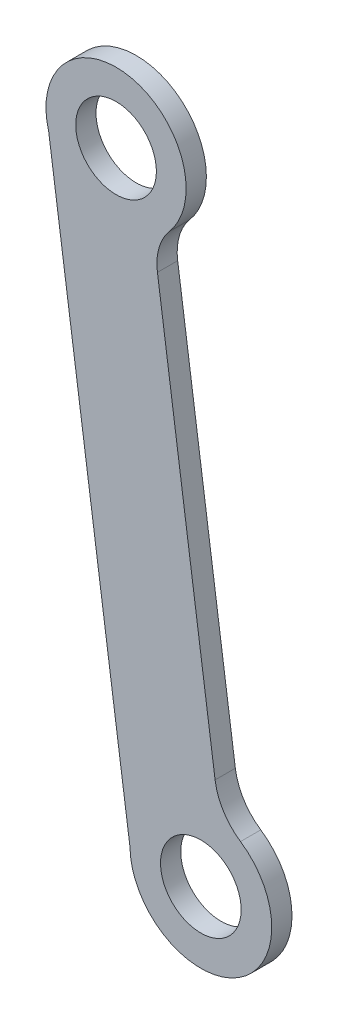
ISO-10303-21;
HEADER;
FILE_DESCRIPTION(('STEP AP214'),'2;1');
FILE_NAME('part.step','',(''),(''),'','','');
FILE_SCHEMA(('AUTOMOTIVE_DESIGN { 1 0 10303 214 1 1 1 1 }'));
ENDSEC;
DATA;
#1=APPLICATION_CONTEXT('core data for automotive mechanical design processes');
#2=APPLICATION_PROTOCOL_DEFINITION('international standard','automotive_design',2000,#1);
#3=PRODUCT_CONTEXT('',#1,'mechanical');
#4=PRODUCT('Part','Part','',(#3));
#5=PRODUCT_RELATED_PRODUCT_CATEGORY('part','',(#4));
#6=PRODUCT_DEFINITION_FORMATION('','',#4);
#7=PRODUCT_DEFINITION_CONTEXT('part definition',#1,'design');
#8=PRODUCT_DEFINITION('design','',#6,#7);
#9=PRODUCT_DEFINITION_SHAPE('','',#8);
#10=(LENGTH_UNIT() NAMED_UNIT(*) SI_UNIT(.MILLI.,.METRE.));
#11=(NAMED_UNIT(*) PLANE_ANGLE_UNIT() SI_UNIT($,.RADIAN.));
#12=(NAMED_UNIT(*) SI_UNIT($,.STERADIAN.) SOLID_ANGLE_UNIT());
#13=UNCERTAINTY_MEASURE_WITH_UNIT(LENGTH_MEASURE(1.E-05),#10,'distance_accuracy_value','');
#14=(GEOMETRIC_REPRESENTATION_CONTEXT(3) GLOBAL_UNCERTAINTY_ASSIGNED_CONTEXT((#13)) GLOBAL_UNIT_ASSIGNED_CONTEXT((#10,
#11,#12)) REPRESENTATION_CONTEXT('',''));
#15=CARTESIAN_POINT('',(0.,0.,0.));
#16=DIRECTION('',(0.,0.,1.));
#17=DIRECTION('',(1.,0.,0.));
#18=AXIS2_PLACEMENT_3D('',#15,#16,#17);
#19=CARTESIAN_POINT('',(355.121430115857,236.791402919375,-2.));
#20=DIRECTION('',(0.,0.,1.));
#21=DIRECTION('',(-0.961342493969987,-0.275355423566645,0.));
#22=AXIS2_PLACEMENT_3D('',#19,#20,#21);
#23=CYLINDRICAL_SURFACE('',#22,5.81601703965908);
#24=CARTESIAN_POINT('',(355.121430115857,236.791402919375,0.));
#25=DIRECTION('',(0.,0.,1.));
#26=DIRECTION('',(0.961342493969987,0.275355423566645,0.));
#27=AXIS2_PLACEMENT_3D('',#24,#25,#26);
#28=CIRCLE('',#27,5.81601703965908);
#29=CARTESIAN_POINT('',(349.361895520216,235.982814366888,0.));
#30=VERTEX_POINT('',#29);
#31=CARTESIAN_POINT('',(351.872505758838,231.967447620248,0.));
#32=VERTEX_POINT('',#31);
#33=EDGE_CURVE('E91',#30,#32,#28,.T.);
#34=ORIENTED_EDGE('',*,*,#33,.T.);
#35=DIRECTION('',(0.,0.,1.));
#36=VECTOR('',#35,1.);
#37=CARTESIAN_POINT('',(351.872505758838,231.967447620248,-2.));
#38=LINE('',#37,#36);
#39=CARTESIAN_POINT('',(351.872505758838,231.967447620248,-2.));
#40=VERTEX_POINT('',#39);
#41=EDGE_CURVE('E35',#40,#32,#38,.T.);
#42=ORIENTED_EDGE('',*,*,#41,.F.);
#43=CARTESIAN_POINT('',(355.121430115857,236.791402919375,-2.));
#44=DIRECTION('',(0.,0.,1.));
#45=DIRECTION('',(0.961342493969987,0.275355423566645,0.));
#46=AXIS2_PLACEMENT_3D('',#43,#44,#45);
#47=CIRCLE('',#46,5.81601703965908);
#48=CARTESIAN_POINT('',(349.361895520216,235.982814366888,-2.));
#49=VERTEX_POINT('',#48);
#50=EDGE_CURVE('E118',#49,#40,#47,.T.);
#51=ORIENTED_EDGE('',*,*,#50,.F.);
#52=DIRECTION('',(0.,0.,1.));
#53=VECTOR('',#52,1.);
#54=CARTESIAN_POINT('',(349.361895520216,235.982814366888,-2.));
#55=LINE('',#54,#53);
#56=EDGE_CURVE('E11',#49,#30,#55,.T.);
#57=ORIENTED_EDGE('',*,*,#56,.T.);
#58=EDGE_LOOP('',(#34,#42,#51,#57));
#59=FACE_BOUND('',#58,.T.);
#60=ADVANCED_FACE('F32',(#59),#23,.F.);
#61=CARTESIAN_POINT('',(349.361895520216,235.982814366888,-2.));
#62=DIRECTION('',(0.990288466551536,0.139027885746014,0.));
#63=DIRECTION('',(0.139027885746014,-0.990288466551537,0.));
#64=AXIS2_PLACEMENT_3D('',#61,#62,#63);
#65=PLANE('',#64);
#66=DIRECTION('',(0.139027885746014,-0.990288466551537,0.));
#67=VECTOR('',#66,1.);
#68=CARTESIAN_POINT('',(349.361895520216,235.982814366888,0.));
#69=LINE('',#68,#67);
#70=CARTESIAN_POINT('',(343.668341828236,276.53770394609,0.));
#71=VERTEX_POINT('',#70);
#72=EDGE_CURVE('E116',#71,#30,#69,.T.);
#73=ORIENTED_EDGE('',*,*,#72,.T.);
#74=ORIENTED_EDGE('',*,*,#56,.F.);
#75=DIRECTION('',(0.139027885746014,-0.990288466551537,0.));
#76=VECTOR('',#75,1.);
#77=CARTESIAN_POINT('',(349.361895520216,235.982814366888,-2.));
#78=LINE('',#77,#76);
#79=CARTESIAN_POINT('',(343.668341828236,276.53770394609,-2.));
#80=VERTEX_POINT('',#79);
#81=EDGE_CURVE('E48',#80,#49,#78,.T.);
#82=ORIENTED_EDGE('',*,*,#81,.F.);
#83=DIRECTION('',(0.,0.,1.));
#84=VECTOR('',#83,1.);
#85=CARTESIAN_POINT('',(343.668341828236,276.53770394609,-2.));
#86=LINE('',#85,#84);
#87=EDGE_CURVE('E40',#80,#71,#86,.T.);
#88=ORIENTED_EDGE('',*,*,#87,.T.);
#89=EDGE_LOOP('',(#73,#74,#82,#88));
#90=FACE_BOUND('',#89,.T.);
#91=ADVANCED_FACE('F147',(#90),#65,.T.);
#92=CARTESIAN_POINT('',(348.856927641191,277.266136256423,-2.));
#93=DIRECTION('',(0.,0.,1.));
#94=DIRECTION('',(-0.961342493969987,-0.275355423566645,0.));
#95=AXIS2_PLACEMENT_3D('',#92,#93,#94);
#96=CYLINDRICAL_SURFACE('',#95,5.23946909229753);
#97=CARTESIAN_POINT('',(348.856927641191,277.266136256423,0.));
#98=DIRECTION('',(0.,0.,1.));
#99=DIRECTION('',(-0.961342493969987,-0.275355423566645,0.));
#100=AXIS2_PLACEMENT_3D('',#97,#98,#99);
#101=CIRCLE('',#100,5.23946909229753);
#102=CARTESIAN_POINT('',(344.756292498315,280.527551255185,0.));
#103=VERTEX_POINT('',#102);
#104=EDGE_CURVE('E114',#103,#71,#101,.T.);
#105=ORIENTED_EDGE('',*,*,#104,.T.);
#106=ORIENTED_EDGE('',*,*,#87,.F.);
#107=CARTESIAN_POINT('',(348.856927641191,277.266136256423,-2.));
#108=DIRECTION('',(0.,0.,1.));
#109=DIRECTION('',(-0.961342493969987,-0.275355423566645,0.));
#110=AXIS2_PLACEMENT_3D('',#107,#108,#109);
#111=CIRCLE('',#110,5.23946909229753);
#112=CARTESIAN_POINT('',(344.756292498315,280.527551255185,-2.));
#113=VERTEX_POINT('',#112);
#114=EDGE_CURVE('E53',#113,#80,#111,.T.);
#115=ORIENTED_EDGE('',*,*,#114,.F.);
#116=DIRECTION('',(0.,0.,1.));
#117=VECTOR('',#116,1.);
#118=CARTESIAN_POINT('',(344.756292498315,280.527551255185,-2.));
#119=LINE('',#118,#117);
#120=EDGE_CURVE('E129',#113,#103,#119,.T.);
#121=ORIENTED_EDGE('',*,*,#120,.T.);
#122=EDGE_LOOP('',(#105,#106,#115,#121));
#123=FACE_BOUND('',#122,.T.);
#124=ADVANCED_FACE('F145',(#123),#96,.F.);
#125=CARTESIAN_POINT('',(339.583114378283,285.123562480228,-2.));
#126=DIRECTION('',(0.,0.,1.));
#127=DIRECTION('',(-0.961342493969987,-0.275355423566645,0.));
#128=AXIS2_PLACEMENT_3D('',#125,#126,#127);
#129=CYLINDRICAL_SURFACE('',#128,6.91990542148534);
#130=CARTESIAN_POINT('',(339.583114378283,285.123562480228,0.));
#131=DIRECTION('',(0.,0.,-1.));
#132=DIRECTION('',(-0.961342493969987,-0.275355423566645,0.));
#133=AXIS2_PLACEMENT_3D('',#130,#131,#132);
#134=CIRCLE('',#133,6.91990542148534);
#135=CARTESIAN_POINT('',(332.930715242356,283.218128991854,0.));
#136=VERTEX_POINT('',#135);
#137=EDGE_CURVE('E112',#136,#103,#134,.T.);
#138=ORIENTED_EDGE('',*,*,#137,.T.);
#139=ORIENTED_EDGE('',*,*,#120,.F.);
#140=CARTESIAN_POINT('',(339.583114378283,285.123562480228,-2.));
#141=DIRECTION('',(0.,0.,-1.));
#142=DIRECTION('',(-0.961342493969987,-0.275355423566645,0.));
#143=AXIS2_PLACEMENT_3D('',#140,#141,#142);
#144=CIRCLE('',#143,6.91990542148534);
#145=CARTESIAN_POINT('',(332.930715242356,283.218128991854,-2.));
#146=VERTEX_POINT('',#145);
#147=EDGE_CURVE('E123',#146,#113,#144,.T.);
#148=ORIENTED_EDGE('',*,*,#147,.F.);
#149=DIRECTION('',(0.,0.,1.));
#150=VECTOR('',#149,1.);
#151=CARTESIAN_POINT('',(332.930715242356,283.218128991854,-2.));
#152=LINE('',#151,#150);
#153=EDGE_CURVE('E132',#146,#136,#152,.T.);
#154=ORIENTED_EDGE('',*,*,#153,.T.);
#155=EDGE_LOOP('',(#138,#139,#148,#154));
#156=FACE_BOUND('',#155,.T.);
#157=ADVANCED_FACE('F142',(#156),#129,.T.);
#158=CARTESIAN_POINT('',(332.930715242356,283.218128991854,-2.));
#159=DIRECTION('',(-0.990288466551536,-0.139027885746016,0.));
#160=DIRECTION('',(-0.139027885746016,0.990288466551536,0.));
#161=AXIS2_PLACEMENT_3D('',#158,#159,#160);
#162=PLANE('',#161);
#163=DIRECTION('',(-0.139027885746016,0.990288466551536,0.));
#164=VECTOR('',#163,1.);
#165=CARTESIAN_POINT('',(332.930715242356,283.218128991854,0.));
#166=LINE('',#165,#164);
#167=CARTESIAN_POINT('',(340.954066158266,226.068213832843,0.));
#168=VERTEX_POINT('',#167);
#169=EDGE_CURVE('E93',#168,#136,#166,.T.);
#170=ORIENTED_EDGE('',*,*,#169,.T.);
#171=ORIENTED_EDGE('',*,*,#153,.F.);
#172=DIRECTION('',(-0.139027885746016,0.990288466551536,0.));
#173=VECTOR('',#172,1.);
#174=CARTESIAN_POINT('',(332.930715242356,283.218128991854,-2.));
#175=LINE('',#174,#173);
#176=CARTESIAN_POINT('',(340.954066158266,226.068213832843,-2.));
#177=VERTEX_POINT('',#176);
#178=EDGE_CURVE('E121',#177,#146,#175,.T.);
#179=ORIENTED_EDGE('',*,*,#178,.F.);
#180=DIRECTION('',(0.,0.,1.));
#181=VECTOR('',#180,1.);
#182=CARTESIAN_POINT('',(340.954066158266,226.068213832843,-2.));
#183=LINE('',#182,#181);
#184=EDGE_CURVE('E103',#177,#168,#183,.T.);
#185=ORIENTED_EDGE('',*,*,#184,.T.);
#186=EDGE_LOOP('',(#170,#171,#179,#185));
#187=FACE_BOUND('',#186,.T.);
#188=ADVANCED_FACE('F136',(#187),#162,.T.);
#189=CARTESIAN_POINT('',(347.95470235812,226.164941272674,-2.));
#190=DIRECTION('',(0.,0.,1.));
#191=DIRECTION('',(-0.961342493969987,-0.275355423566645,0.));
#192=AXIS2_PLACEMENT_3D('',#189,#190,#191);
#193=CYLINDRICAL_SURFACE('',#192,7.00130440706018);
#194=CARTESIAN_POINT('',(347.95470235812,226.164941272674,0.));
#195=DIRECTION('',(0.,0.,-1.));
#196=DIRECTION('',(-0.961342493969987,-0.275355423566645,0.));
#197=AXIS2_PLACEMENT_3D('',#194,#195,#196);
#198=CIRCLE('',#197,7.00130440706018);
#199=EDGE_CURVE('E86',#32,#168,#198,.T.);
#200=ORIENTED_EDGE('',*,*,#199,.T.);
#201=ORIENTED_EDGE('',*,*,#184,.F.);
#202=CARTESIAN_POINT('',(347.95470235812,226.164941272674,-2.));
#203=DIRECTION('',(0.,0.,-1.));
#204=DIRECTION('',(-0.961342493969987,-0.275355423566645,0.));
#205=AXIS2_PLACEMENT_3D('',#202,#203,#204);
#206=CIRCLE('',#205,7.00130440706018);
#207=EDGE_CURVE('E100',#40,#177,#206,.T.);
#208=ORIENTED_EDGE('',*,*,#207,.F.);
#209=ORIENTED_EDGE('',*,*,#41,.T.);
#210=EDGE_LOOP('',(#200,#201,#208,#209));
#211=FACE_BOUND('',#210,.T.);
#212=ADVANCED_FACE('F99',(#211),#193,.T.);
#213=CARTESIAN_POINT('',(355.121430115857,236.791402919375,-2.));
#214=DIRECTION('',(0.,0.,-1.));
#215=DIRECTION('',(0.961342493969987,0.275355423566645,0.));
#216=AXIS2_PLACEMENT_3D('',#213,#214,#215);
#217=PLANE('',#216);
#218=CARTESIAN_POINT('',(339.583114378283,285.123562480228,-2.));
#219=DIRECTION('',(0.,0.,-1.));
#220=DIRECTION('',(-0.961342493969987,-0.275355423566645,0.));
#221=AXIS2_PLACEMENT_3D('',#218,#219,#220);
#222=CIRCLE('',#221,3.98165201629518);
#223=CARTESIAN_POINT('',(335.755383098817,284.027193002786,-2.));
#224=VERTEX_POINT('',#223);
#225=EDGE_CURVE('E174',#224,#224,#222,.T.);
#226=ORIENTED_EDGE('',*,*,#225,.F.);
#227=EDGE_LOOP('',(#226));
#228=FACE_BOUND('',#227,.T.);
#229=CARTESIAN_POINT('',(347.95470235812,226.164941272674,-2.));
#230=DIRECTION('',(0.,0.,-1.));
#231=DIRECTION('',(-0.961342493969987,-0.275355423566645,0.));
#232=AXIS2_PLACEMENT_3D('',#229,#230,#231);
#233=CIRCLE('',#232,3.98165201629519);
#234=CARTESIAN_POINT('',(344.126971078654,225.068571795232,-2.));
#235=VERTEX_POINT('',#234);
#236=EDGE_CURVE('E104',#235,#235,#233,.T.);
#237=ORIENTED_EDGE('',*,*,#236,.F.);
#238=EDGE_LOOP('',(#237));
#239=FACE_BOUND('',#238,.T.);
#240=ORIENTED_EDGE('',*,*,#50,.T.);
#241=ORIENTED_EDGE('',*,*,#207,.T.);
#242=ORIENTED_EDGE('',*,*,#178,.T.);
#243=ORIENTED_EDGE('',*,*,#147,.T.);
#244=ORIENTED_EDGE('',*,*,#114,.T.);
#245=ORIENTED_EDGE('',*,*,#81,.T.);
#246=EDGE_LOOP('',(#240,#241,#242,#243,#244,#245));
#247=FACE_BOUND('',#246,.T.);
#248=ADVANCED_FACE('F139',(#228,#239,#247),#217,.T.);
#249=CARTESIAN_POINT('',(355.121430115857,236.791402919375,0.));
#250=DIRECTION('',(0.,0.,-1.));
#251=DIRECTION('',(0.961342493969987,0.275355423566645,0.));
#252=AXIS2_PLACEMENT_3D('',#249,#250,#251);
#253=PLANE('',#252);
#254=CARTESIAN_POINT('',(339.583114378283,285.123562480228,0.));
#255=DIRECTION('',(0.,0.,-1.));
#256=DIRECTION('',(-0.961342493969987,-0.275355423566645,0.));
#257=AXIS2_PLACEMENT_3D('',#254,#255,#256);
#258=CIRCLE('',#257,3.98165201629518);
#259=CARTESIAN_POINT('',(335.755383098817,284.027193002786,0.));
#260=VERTEX_POINT('',#259);
#261=EDGE_CURVE('E184',#260,#260,#258,.T.);
#262=ORIENTED_EDGE('',*,*,#261,.T.);
#263=EDGE_LOOP('',(#262));
#264=FACE_BOUND('',#263,.T.);
#265=CARTESIAN_POINT('',(347.95470235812,226.164941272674,0.));
#266=DIRECTION('',(0.,0.,-1.));
#267=DIRECTION('',(-0.961342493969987,-0.275355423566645,0.));
#268=AXIS2_PLACEMENT_3D('',#265,#266,#267);
#269=CIRCLE('',#268,3.98165201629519);
#270=CARTESIAN_POINT('',(344.126971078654,225.068571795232,0.));
#271=VERTEX_POINT('',#270);
#272=EDGE_CURVE('E107',#271,#271,#269,.T.);
#273=ORIENTED_EDGE('',*,*,#272,.T.);
#274=EDGE_LOOP('',(#273));
#275=FACE_BOUND('',#274,.T.);
#276=ORIENTED_EDGE('',*,*,#33,.F.);
#277=ORIENTED_EDGE('',*,*,#72,.F.);
#278=ORIENTED_EDGE('',*,*,#104,.F.);
#279=ORIENTED_EDGE('',*,*,#137,.F.);
#280=ORIENTED_EDGE('',*,*,#169,.F.);
#281=ORIENTED_EDGE('',*,*,#199,.F.);
#282=EDGE_LOOP('',(#276,#277,#278,#279,#280,#281));
#283=FACE_BOUND('',#282,.T.);
#284=ADVANCED_FACE('F88',(#264,#275,#283),#253,.F.);
#285=CARTESIAN_POINT('',(347.95470235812,226.164941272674,-2.));
#286=DIRECTION('',(0.,0.,1.));
#287=DIRECTION('',(-0.961342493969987,-0.275355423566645,0.));
#288=AXIS2_PLACEMENT_3D('',#285,#286,#287);
#289=CYLINDRICAL_SURFACE('',#288,3.98165201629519);
#290=ORIENTED_EDGE('',*,*,#236,.T.);
#291=EDGE_LOOP('',(#290));
#292=FACE_BOUND('',#291,.T.);
#293=ORIENTED_EDGE('',*,*,#272,.F.);
#294=EDGE_LOOP('',(#293));
#295=FACE_BOUND('',#294,.T.);
#296=ADVANCED_FACE('F169',(#292,#295),#289,.F.);
#297=CARTESIAN_POINT('',(339.583114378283,285.123562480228,-2.));
#298=DIRECTION('',(0.,0.,1.));
#299=DIRECTION('',(-0.961342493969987,-0.275355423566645,0.));
#300=AXIS2_PLACEMENT_3D('',#297,#298,#299);
#301=CYLINDRICAL_SURFACE('',#300,3.98165201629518);
#302=ORIENTED_EDGE('',*,*,#225,.T.);
#303=EDGE_LOOP('',(#302));
#304=FACE_BOUND('',#303,.T.);
#305=ORIENTED_EDGE('',*,*,#261,.F.);
#306=EDGE_LOOP('',(#305));
#307=FACE_BOUND('',#306,.T.);
#308=ADVANCED_FACE('F179',(#304,#307),#301,.F.);
#309=CLOSED_SHELL('',(#60,#91,#124,#157,#188,#212,#248,#284,#296,#308));
#310=MANIFOLD_SOLID_BREP('B2',#309);
#311=ADVANCED_BREP_SHAPE_REPRESENTATION('',(#18,#310),#14);
#312=SHAPE_DEFINITION_REPRESENTATION(#9,#311);
ENDSEC;
END-ISO-10303-21;
